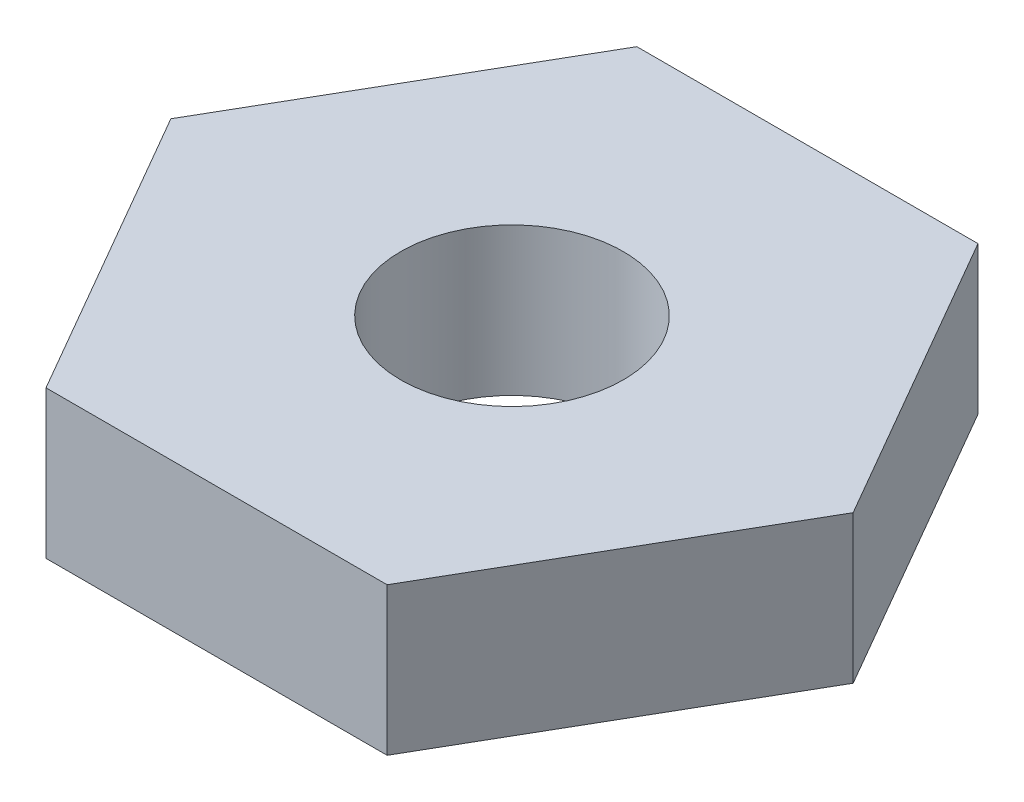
from build123d import *

# Parameters (mm, degrees)
SKETCH1_R           = 1.13
BOSS_EXTRUDE1_DEPTH = 1.5


with BuildPart() as part:
    # Sketch1 → Boss-Extrude1 (new body)
    with BuildSketch(Plane(origin=(0, 0, 0), x_dir=(1, 0, 0), z_dir=(0, 1, 0))):
        Polygon((3.464101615, 0), (1.732050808, 3), (-1.732050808, 3), (-3.464101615, 0), (-1.732050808, -3), (1.732050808, -3), align=None)
        with Locations(Location((0, 0, 0), (0, 0, 270))):
            Circle(SKETCH1_R, mode=Mode.SUBTRACT)
    extrude(amount=BOSS_EXTRUDE1_DEPTH)


solid = part.part
